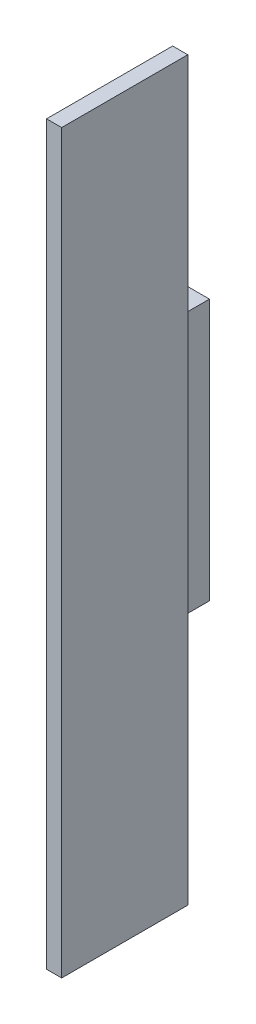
ISO-10303-21;
HEADER;
FILE_DESCRIPTION(('STEP AP214'),'2;1');
FILE_NAME('part.step','',(''),(''),'','','');
FILE_SCHEMA(('AUTOMOTIVE_DESIGN { 1 0 10303 214 1 1 1 1 }'));
ENDSEC;
DATA;
#1=APPLICATION_CONTEXT('core data for automotive mechanical design processes');
#2=APPLICATION_PROTOCOL_DEFINITION('international standard','automotive_design',2000,#1);
#3=PRODUCT_CONTEXT('',#1,'mechanical');
#4=PRODUCT('Part','Part','',(#3));
#5=PRODUCT_RELATED_PRODUCT_CATEGORY('part','',(#4));
#6=PRODUCT_DEFINITION_FORMATION('','',#4);
#7=PRODUCT_DEFINITION_CONTEXT('part definition',#1,'design');
#8=PRODUCT_DEFINITION('design','',#6,#7);
#9=PRODUCT_DEFINITION_SHAPE('','',#8);
#10=(LENGTH_UNIT() NAMED_UNIT(*) SI_UNIT(.MILLI.,.METRE.));
#11=(NAMED_UNIT(*) PLANE_ANGLE_UNIT() SI_UNIT($,.RADIAN.));
#12=(NAMED_UNIT(*) SI_UNIT($,.STERADIAN.) SOLID_ANGLE_UNIT());
#13=UNCERTAINTY_MEASURE_WITH_UNIT(LENGTH_MEASURE(1.E-05),#10,'distance_accuracy_value','');
#14=(GEOMETRIC_REPRESENTATION_CONTEXT(3) GLOBAL_UNCERTAINTY_ASSIGNED_CONTEXT((#13)) GLOBAL_UNIT_ASSIGNED_CONTEXT((#10,
#11,#12)) REPRESENTATION_CONTEXT('',''));
#15=CARTESIAN_POINT('',(0.,0.,0.));
#16=DIRECTION('',(0.,0.,1.));
#17=DIRECTION('',(1.,0.,0.));
#18=AXIS2_PLACEMENT_3D('',#15,#16,#17);
#19=CARTESIAN_POINT('',(0.,73.,25.));
#20=DIRECTION('',(-1.,0.,0.));
#21=DIRECTION('',(0.,-1.,0.));
#22=AXIS2_PLACEMENT_3D('',#19,#20,#21);
#23=PLANE('',#22);
#24=DIRECTION('',(0.,-1.,0.));
#25=VECTOR('',#24,1.);
#26=CARTESIAN_POINT('',(0.,-35.,7.69999999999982));
#27=LINE('',#26,#25);
#28=CARTESIAN_POINT('',(0.,35.,7.69999999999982));
#29=VERTEX_POINT('',#28);
#30=CARTESIAN_POINT('',(0.,-35.,7.69999999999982));
#31=VERTEX_POINT('',#30);
#32=EDGE_CURVE('E32',#29,#31,#27,.T.);
#33=ORIENTED_EDGE('',*,*,#32,.T.);
#34=DIRECTION('',(0.,0.,-1.));
#35=VECTOR('',#34,1.);
#36=CARTESIAN_POINT('',(0.,-35.,0.));
#37=LINE('',#36,#35);
#38=CARTESIAN_POINT('',(0.,-35.,0.));
#39=VERTEX_POINT('',#38);
#40=EDGE_CURVE('E18',#31,#39,#37,.T.);
#41=ORIENTED_EDGE('',*,*,#40,.T.);
#42=DIRECTION('',(0.,1.,0.));
#43=VECTOR('',#42,1.);
#44=CARTESIAN_POINT('',(0.,-73.,0.));
#45=LINE('',#44,#43);
#46=CARTESIAN_POINT('',(0.,-73.,0.));
#47=VERTEX_POINT('',#46);
#48=EDGE_CURVE('E178',#47,#39,#45,.T.);
#49=ORIENTED_EDGE('',*,*,#48,.F.);
#50=DIRECTION('',(0.,0.,-1.));
#51=VECTOR('',#50,1.);
#52=CARTESIAN_POINT('',(0.,-73.,25.));
#53=LINE('',#52,#51);
#54=CARTESIAN_POINT('',(0.,-73.,25.));
#55=VERTEX_POINT('',#54);
#56=EDGE_CURVE('E165',#55,#47,#53,.T.);
#57=ORIENTED_EDGE('',*,*,#56,.F.);
#58=DIRECTION('',(0.,-1.,0.));
#59=VECTOR('',#58,1.);
#60=CARTESIAN_POINT('',(0.,73.,25.));
#61=LINE('',#60,#59);
#62=CARTESIAN_POINT('',(0.,73.,25.));
#63=VERTEX_POINT('',#62);
#64=EDGE_CURVE('E155',#63,#55,#61,.T.);
#65=ORIENTED_EDGE('',*,*,#64,.F.);
#66=DIRECTION('',(0.,0.,1.));
#67=VECTOR('',#66,1.);
#68=CARTESIAN_POINT('',(0.,73.,0.));
#69=LINE('',#68,#67);
#70=CARTESIAN_POINT('',(0.,73.,0.));
#71=VERTEX_POINT('',#70);
#72=EDGE_CURVE('E170',#71,#63,#69,.T.);
#73=ORIENTED_EDGE('',*,*,#72,.F.);
#74=CARTESIAN_POINT('',(0.,34.9999999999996,0.));
#75=VERTEX_POINT('',#74);
#76=EDGE_CURVE('E167',#75,#71,#45,.T.);
#77=ORIENTED_EDGE('',*,*,#76,.F.);
#78=DIRECTION('',(0.,0.,1.));
#79=VECTOR('',#78,1.);
#80=CARTESIAN_POINT('',(0.,35.,7.69999999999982));
#81=LINE('',#80,#79);
#82=EDGE_CURVE('E125',#75,#29,#81,.T.);
#83=ORIENTED_EDGE('',*,*,#82,.T.);
#84=EDGE_LOOP('',(#33,#41,#49,#57,#65,#73,#77,#83));
#85=FACE_BOUND('',#84,.T.);
#86=ADVANCED_FACE('F14',(#85),#23,.T.);
#87=CARTESIAN_POINT('',(3.,73.,25.));
#88=DIRECTION('',(0.,0.,-1.));
#89=DIRECTION('',(0.,1.,0.));
#90=AXIS2_PLACEMENT_3D('',#87,#88,#89);
#91=PLANE('',#90);
#92=ORIENTED_EDGE('',*,*,#64,.T.);
#93=DIRECTION('',(-1.,0.,0.));
#94=VECTOR('',#93,1.);
#95=CARTESIAN_POINT('',(3.,-73.,25.));
#96=LINE('',#95,#94);
#97=CARTESIAN_POINT('',(3.,-73.,25.));
#98=VERTEX_POINT('',#97);
#99=EDGE_CURVE('E9',#98,#55,#96,.T.);
#100=ORIENTED_EDGE('',*,*,#99,.F.);
#101=DIRECTION('',(0.,-1.,0.));
#102=VECTOR('',#101,1.);
#103=CARTESIAN_POINT('',(3.,73.,25.));
#104=LINE('',#103,#102);
#105=CARTESIAN_POINT('',(3.,73.,25.));
#106=VERTEX_POINT('',#105);
#107=EDGE_CURVE('E196',#106,#98,#104,.T.);
#108=ORIENTED_EDGE('',*,*,#107,.F.);
#109=DIRECTION('',(-1.,0.,0.));
#110=VECTOR('',#109,1.);
#111=CARTESIAN_POINT('',(3.,73.,25.));
#112=LINE('',#111,#110);
#113=EDGE_CURVE('E193',#106,#63,#112,.T.);
#114=ORIENTED_EDGE('',*,*,#113,.T.);
#115=EDGE_LOOP('',(#92,#100,#108,#114));
#116=FACE_BOUND('',#115,.T.);
#117=ADVANCED_FACE('F16',(#116),#91,.F.);
#118=CARTESIAN_POINT('',(3.,-73.,25.));
#119=DIRECTION('',(0.,1.,0.));
#120=DIRECTION('',(0.,0.,1.));
#121=AXIS2_PLACEMENT_3D('',#118,#119,#120);
#122=PLANE('',#121);
#123=ORIENTED_EDGE('',*,*,#56,.T.);
#124=DIRECTION('',(-1.,0.,0.));
#125=VECTOR('',#124,1.);
#126=CARTESIAN_POINT('',(3.,-73.,0.));
#127=LINE('',#126,#125);
#128=CARTESIAN_POINT('',(3.,-73.,0.));
#129=VERTEX_POINT('',#128);
#130=EDGE_CURVE('E24',#129,#47,#127,.T.);
#131=ORIENTED_EDGE('',*,*,#130,.F.);
#132=DIRECTION('',(0.,0.,-1.));
#133=VECTOR('',#132,1.);
#134=CARTESIAN_POINT('',(3.,-73.,25.));
#135=LINE('',#134,#133);
#136=EDGE_CURVE('E197',#98,#129,#135,.T.);
#137=ORIENTED_EDGE('',*,*,#136,.F.);
#138=ORIENTED_EDGE('',*,*,#99,.T.);
#139=EDGE_LOOP('',(#123,#131,#137,#138));
#140=FACE_BOUND('',#139,.T.);
#141=ADVANCED_FACE('F208',(#140),#122,.F.);
#142=CARTESIAN_POINT('',(3.,-73.,0.));
#143=DIRECTION('',(0.,0.,1.));
#144=DIRECTION('',(1.,0.,0.));
#145=AXIS2_PLACEMENT_3D('',#142,#143,#144);
#146=PLANE('',#145);
#147=ORIENTED_EDGE('',*,*,#48,.T.);
#148=DIRECTION('',(1.,0.,0.));
#149=VECTOR('',#148,1.);
#150=CARTESIAN_POINT('',(-6.,-35.,0.));
#151=LINE('',#150,#149);
#152=CARTESIAN_POINT('',(-6.,-35.,0.));
#153=VERTEX_POINT('',#152);
#154=EDGE_CURVE('E113',#153,#39,#151,.T.);
#155=ORIENTED_EDGE('',*,*,#154,.F.);
#156=DIRECTION('',(0.,1.,0.));
#157=VECTOR('',#156,1.);
#158=CARTESIAN_POINT('',(-6.,-35.,0.));
#159=LINE('',#158,#157);
#160=CARTESIAN_POINT('',(-6.,-25.9,0.));
#161=VERTEX_POINT('',#160);
#162=EDGE_CURVE('E136',#153,#161,#159,.T.);
#163=ORIENTED_EDGE('',*,*,#162,.T.);
#164=DIRECTION('',(1.,0.,0.));
#165=VECTOR('',#164,1.);
#166=CARTESIAN_POINT('',(-6.,-25.9,0.));
#167=LINE('',#166,#165);
#168=CARTESIAN_POINT('',(0.,-25.9,0.));
#169=VERTEX_POINT('',#168);
#170=EDGE_CURVE('E161',#161,#169,#167,.T.);
#171=ORIENTED_EDGE('',*,*,#170,.T.);
#172=CARTESIAN_POINT('',(0.,25.9,0.));
#173=VERTEX_POINT('',#172);
#174=EDGE_CURVE('E179',#169,#173,#45,.T.);
#175=ORIENTED_EDGE('',*,*,#174,.T.);
#176=DIRECTION('',(1.,0.,0.));
#177=VECTOR('',#176,1.);
#178=CARTESIAN_POINT('',(-6.,25.9,0.));
#179=LINE('',#178,#177);
#180=CARTESIAN_POINT('',(-6.,25.9,0.));
#181=VERTEX_POINT('',#180);
#182=EDGE_CURVE('E159',#181,#173,#179,.T.);
#183=ORIENTED_EDGE('',*,*,#182,.F.);
#184=DIRECTION('',(0.,1.,0.));
#185=VECTOR('',#184,1.);
#186=CARTESIAN_POINT('',(-6.,25.9,0.));
#187=LINE('',#186,#185);
#188=CARTESIAN_POINT('',(-6.,34.9999999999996,0.));
#189=VERTEX_POINT('',#188);
#190=EDGE_CURVE('E148',#181,#189,#187,.T.);
#191=ORIENTED_EDGE('',*,*,#190,.T.);
#192=DIRECTION('',(1.,0.,0.));
#193=VECTOR('',#192,1.);
#194=CARTESIAN_POINT('',(-6.,34.9999999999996,0.));
#195=LINE('',#194,#193);
#196=EDGE_CURVE('E156',#189,#75,#195,.T.);
#197=ORIENTED_EDGE('',*,*,#196,.T.);
#198=ORIENTED_EDGE('',*,*,#76,.T.);
#199=DIRECTION('',(-1.,0.,0.));
#200=VECTOR('',#199,1.);
#201=CARTESIAN_POINT('',(3.,73.,0.));
#202=LINE('',#201,#200);
#203=CARTESIAN_POINT('',(3.,73.,0.));
#204=VERTEX_POINT('',#203);
#205=EDGE_CURVE('E188',#204,#71,#202,.T.);
#206=ORIENTED_EDGE('',*,*,#205,.F.);
#207=DIRECTION('',(0.,1.,0.));
#208=VECTOR('',#207,1.);
#209=CARTESIAN_POINT('',(3.,-73.,0.));
#210=LINE('',#209,#208);
#211=EDGE_CURVE('E200',#129,#204,#210,.T.);
#212=ORIENTED_EDGE('',*,*,#211,.F.);
#213=ORIENTED_EDGE('',*,*,#130,.T.);
#214=EDGE_LOOP('',(#147,#155,#163,#171,#175,#183,#191,#197,#198,#206,#212,#213));
#215=FACE_BOUND('',#214,.T.);
#216=ADVANCED_FACE('F186',(#215),#146,.F.);
#217=CARTESIAN_POINT('',(3.,73.,0.));
#218=DIRECTION('',(0.,-1.,0.));
#219=DIRECTION('',(0.,0.,-1.));
#220=AXIS2_PLACEMENT_3D('',#217,#218,#219);
#221=PLANE('',#220);
#222=ORIENTED_EDGE('',*,*,#72,.T.);
#223=ORIENTED_EDGE('',*,*,#113,.F.);
#224=DIRECTION('',(0.,0.,1.));
#225=VECTOR('',#224,1.);
#226=CARTESIAN_POINT('',(3.,73.,0.));
#227=LINE('',#226,#225);
#228=EDGE_CURVE('E40',#204,#106,#227,.T.);
#229=ORIENTED_EDGE('',*,*,#228,.F.);
#230=ORIENTED_EDGE('',*,*,#205,.T.);
#231=EDGE_LOOP('',(#222,#223,#229,#230));
#232=FACE_BOUND('',#231,.T.);
#233=ADVANCED_FACE('F191',(#232),#221,.F.);
#234=CARTESIAN_POINT('',(3.,73.,25.));
#235=DIRECTION('',(-1.,0.,0.));
#236=DIRECTION('',(0.,-1.,0.));
#237=AXIS2_PLACEMENT_3D('',#234,#235,#236);
#238=PLANE('',#237);
#239=ORIENTED_EDGE('',*,*,#107,.T.);
#240=ORIENTED_EDGE('',*,*,#136,.T.);
#241=ORIENTED_EDGE('',*,*,#211,.T.);
#242=ORIENTED_EDGE('',*,*,#228,.T.);
#243=EDGE_LOOP('',(#239,#240,#241,#242));
#244=FACE_BOUND('',#243,.T.);
#245=ADVANCED_FACE('F224',(#244),#238,.F.);
#246=CARTESIAN_POINT('',(0.,25.9,7.69999999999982));
#247=DIRECTION('',(1.,0.,0.));
#248=DIRECTION('',(0.,1.,0.));
#249=AXIS2_PLACEMENT_3D('',#246,#247,#248);
#250=PLANE('',#249);
#251=ORIENTED_EDGE('',*,*,#174,.F.);
#252=DIRECTION('',(0.,0.,-1.));
#253=VECTOR('',#252,1.);
#254=CARTESIAN_POINT('',(0.,-25.9,0.));
#255=LINE('',#254,#253);
#256=CARTESIAN_POINT('',(0.,-25.9,-7.30000000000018));
#257=VERTEX_POINT('',#256);
#258=EDGE_CURVE('E121',#169,#257,#255,.T.);
#259=ORIENTED_EDGE('',*,*,#258,.T.);
#260=DIRECTION('',(0.,1.,0.));
#261=VECTOR('',#260,1.);
#262=CARTESIAN_POINT('',(0.,-25.9,-7.30000000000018));
#263=LINE('',#262,#261);
#264=CARTESIAN_POINT('',(0.,25.9,-7.30000000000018));
#265=VERTEX_POINT('',#264);
#266=EDGE_CURVE('E129',#257,#265,#263,.T.);
#267=ORIENTED_EDGE('',*,*,#266,.T.);
#268=DIRECTION('',(0.,0.,1.));
#269=VECTOR('',#268,1.);
#270=CARTESIAN_POINT('',(0.,25.9,-7.30000000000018));
#271=LINE('',#270,#269);
#272=EDGE_CURVE('E132',#265,#173,#271,.T.);
#273=ORIENTED_EDGE('',*,*,#272,.T.);
#274=EDGE_LOOP('',(#251,#259,#267,#273));
#275=FACE_BOUND('',#274,.T.);
#276=ADVANCED_FACE('F227',(#275),#250,.T.);
#277=CARTESIAN_POINT('',(-6.,-35.,7.69999999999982));
#278=DIRECTION('',(0.,0.,1.));
#279=DIRECTION('',(1.,0.,0.));
#280=AXIS2_PLACEMENT_3D('',#277,#278,#279);
#281=PLANE('',#280);
#282=ORIENTED_EDGE('',*,*,#32,.F.);
#283=DIRECTION('',(1.,0.,0.));
#284=VECTOR('',#283,1.);
#285=CARTESIAN_POINT('',(-6.,35.,7.69999999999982));
#286=LINE('',#285,#284);
#287=CARTESIAN_POINT('',(-6.,35.,7.69999999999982));
#288=VERTEX_POINT('',#287);
#289=EDGE_CURVE('E153',#288,#29,#286,.T.);
#290=ORIENTED_EDGE('',*,*,#289,.F.);
#291=DIRECTION('',(0.,-1.,0.));
#292=VECTOR('',#291,1.);
#293=CARTESIAN_POINT('',(-6.,-35.,7.69999999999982));
#294=LINE('',#293,#292);
#295=CARTESIAN_POINT('',(-6.,-35.,7.69999999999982));
#296=VERTEX_POINT('',#295);
#297=EDGE_CURVE('E109',#288,#296,#294,.T.);
#298=ORIENTED_EDGE('',*,*,#297,.T.);
#299=DIRECTION('',(1.,0.,0.));
#300=VECTOR('',#299,1.);
#301=CARTESIAN_POINT('',(-6.,-35.,7.69999999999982));
#302=LINE('',#301,#300);
#303=EDGE_CURVE('E105',#296,#31,#302,.T.);
#304=ORIENTED_EDGE('',*,*,#303,.T.);
#305=EDGE_LOOP('',(#282,#290,#298,#304));
#306=FACE_BOUND('',#305,.T.);
#307=ADVANCED_FACE('F107',(#306),#281,.T.);
#308=CARTESIAN_POINT('',(-6.,35.,7.69999999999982));
#309=DIRECTION('',(0.,1.,0.));
#310=DIRECTION('',(0.,0.,1.));
#311=AXIS2_PLACEMENT_3D('',#308,#309,#310);
#312=PLANE('',#311);
#313=ORIENTED_EDGE('',*,*,#82,.F.);
#314=ORIENTED_EDGE('',*,*,#196,.F.);
#315=DIRECTION('',(0.,0.,1.));
#316=VECTOR('',#315,1.);
#317=CARTESIAN_POINT('',(-6.,35.,7.69999999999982));
#318=LINE('',#317,#316);
#319=EDGE_CURVE('E114',#189,#288,#318,.T.);
#320=ORIENTED_EDGE('',*,*,#319,.T.);
#321=ORIENTED_EDGE('',*,*,#289,.T.);
#322=EDGE_LOOP('',(#313,#314,#320,#321));
#323=FACE_BOUND('',#322,.T.);
#324=ADVANCED_FACE('F265',(#323),#312,.T.);
#325=CARTESIAN_POINT('',(-6.,25.9,-7.30000000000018));
#326=DIRECTION('',(0.,1.,0.));
#327=DIRECTION('',(-1.,0.,0.));
#328=AXIS2_PLACEMENT_3D('',#325,#326,#327);
#329=PLANE('',#328);
#330=ORIENTED_EDGE('',*,*,#272,.F.);
#331=DIRECTION('',(1.,0.,0.));
#332=VECTOR('',#331,1.);
#333=CARTESIAN_POINT('',(-6.,25.9,-7.30000000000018));
#334=LINE('',#333,#332);
#335=CARTESIAN_POINT('',(-6.,25.9,-7.30000000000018));
#336=VERTEX_POINT('',#335);
#337=EDGE_CURVE('E157',#336,#265,#334,.T.);
#338=ORIENTED_EDGE('',*,*,#337,.F.);
#339=DIRECTION('',(0.,0.,1.));
#340=VECTOR('',#339,1.);
#341=CARTESIAN_POINT('',(-6.,25.9,-7.30000000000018));
#342=LINE('',#341,#340);
#343=EDGE_CURVE('E145',#336,#181,#342,.T.);
#344=ORIENTED_EDGE('',*,*,#343,.T.);
#345=ORIENTED_EDGE('',*,*,#182,.T.);
#346=EDGE_LOOP('',(#330,#338,#344,#345));
#347=FACE_BOUND('',#346,.T.);
#348=ADVANCED_FACE('F272',(#347),#329,.T.);
#349=CARTESIAN_POINT('',(-6.,-25.9,-7.30000000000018));
#350=DIRECTION('',(0.,0.,-1.));
#351=DIRECTION('',(-1.,0.,0.));
#352=AXIS2_PLACEMENT_3D('',#349,#350,#351);
#353=PLANE('',#352);
#354=ORIENTED_EDGE('',*,*,#266,.F.);
#355=DIRECTION('',(1.,0.,0.));
#356=VECTOR('',#355,1.);
#357=CARTESIAN_POINT('',(-6.,-25.9,-7.30000000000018));
#358=LINE('',#357,#356);
#359=CARTESIAN_POINT('',(-6.,-25.9,-7.30000000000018));
#360=VERTEX_POINT('',#359);
#361=EDGE_CURVE('E160',#360,#257,#358,.T.);
#362=ORIENTED_EDGE('',*,*,#361,.F.);
#363=DIRECTION('',(0.,1.,0.));
#364=VECTOR('',#363,1.);
#365=CARTESIAN_POINT('',(-6.,-25.9,-7.30000000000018));
#366=LINE('',#365,#364);
#367=EDGE_CURVE('E142',#360,#336,#366,.T.);
#368=ORIENTED_EDGE('',*,*,#367,.T.);
#369=ORIENTED_EDGE('',*,*,#337,.T.);
#370=EDGE_LOOP('',(#354,#362,#368,#369));
#371=FACE_BOUND('',#370,.T.);
#372=ADVANCED_FACE('F281',(#371),#353,.T.);
#373=CARTESIAN_POINT('',(-6.,-25.9,0.));
#374=DIRECTION('',(0.,-1.,0.));
#375=DIRECTION('',(1.,0.,0.));
#376=AXIS2_PLACEMENT_3D('',#373,#374,#375);
#377=PLANE('',#376);
#378=ORIENTED_EDGE('',*,*,#258,.F.);
#379=ORIENTED_EDGE('',*,*,#170,.F.);
#380=DIRECTION('',(0.,0.,-1.));
#381=VECTOR('',#380,1.);
#382=CARTESIAN_POINT('',(-6.,-25.9,0.));
#383=LINE('',#382,#381);
#384=EDGE_CURVE('E139',#161,#360,#383,.T.);
#385=ORIENTED_EDGE('',*,*,#384,.T.);
#386=ORIENTED_EDGE('',*,*,#361,.T.);
#387=EDGE_LOOP('',(#378,#379,#385,#386));
#388=FACE_BOUND('',#387,.T.);
#389=ADVANCED_FACE('F290',(#388),#377,.T.);
#390=CARTESIAN_POINT('',(-6.,-35.,0.));
#391=DIRECTION('',(0.,-1.,0.));
#392=DIRECTION('',(1.,0.,0.));
#393=AXIS2_PLACEMENT_3D('',#390,#391,#392);
#394=PLANE('',#393);
#395=ORIENTED_EDGE('',*,*,#40,.F.);
#396=ORIENTED_EDGE('',*,*,#303,.F.);
#397=DIRECTION('',(0.,0.,-1.));
#398=VECTOR('',#397,1.);
#399=CARTESIAN_POINT('',(-6.,-35.,0.));
#400=LINE('',#399,#398);
#401=EDGE_CURVE('E134',#296,#153,#400,.T.);
#402=ORIENTED_EDGE('',*,*,#401,.T.);
#403=ORIENTED_EDGE('',*,*,#154,.T.);
#404=EDGE_LOOP('',(#395,#396,#402,#403));
#405=FACE_BOUND('',#404,.T.);
#406=ADVANCED_FACE('F117',(#405),#394,.T.);
#407=CARTESIAN_POINT('',(-6.,25.9,7.69999999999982));
#408=DIRECTION('',(1.,0.,0.));
#409=DIRECTION('',(0.,1.,0.));
#410=AXIS2_PLACEMENT_3D('',#407,#408,#409);
#411=PLANE('',#410);
#412=ORIENTED_EDGE('',*,*,#297,.F.);
#413=ORIENTED_EDGE('',*,*,#319,.F.);
#414=ORIENTED_EDGE('',*,*,#190,.F.);
#415=ORIENTED_EDGE('',*,*,#343,.F.);
#416=ORIENTED_EDGE('',*,*,#367,.F.);
#417=ORIENTED_EDGE('',*,*,#384,.F.);
#418=ORIENTED_EDGE('',*,*,#162,.F.);
#419=ORIENTED_EDGE('',*,*,#401,.F.);
#420=EDGE_LOOP('',(#412,#413,#414,#415,#416,#417,#418,#419));
#421=FACE_BOUND('',#420,.T.);
#422=ADVANCED_FACE('F307',(#421),#411,.F.);
#423=CLOSED_SHELL('',(#86,#117,#141,#216,#233,#245,#276,#307,#324,#348,#372,#389,#406,#422));
#424=MANIFOLD_SOLID_BREP('B1',#423);
#425=ADVANCED_BREP_SHAPE_REPRESENTATION('',(#18,#424),#14);
#426=SHAPE_DEFINITION_REPRESENTATION(#9,#425);
ENDSEC;
END-ISO-10303-21;
